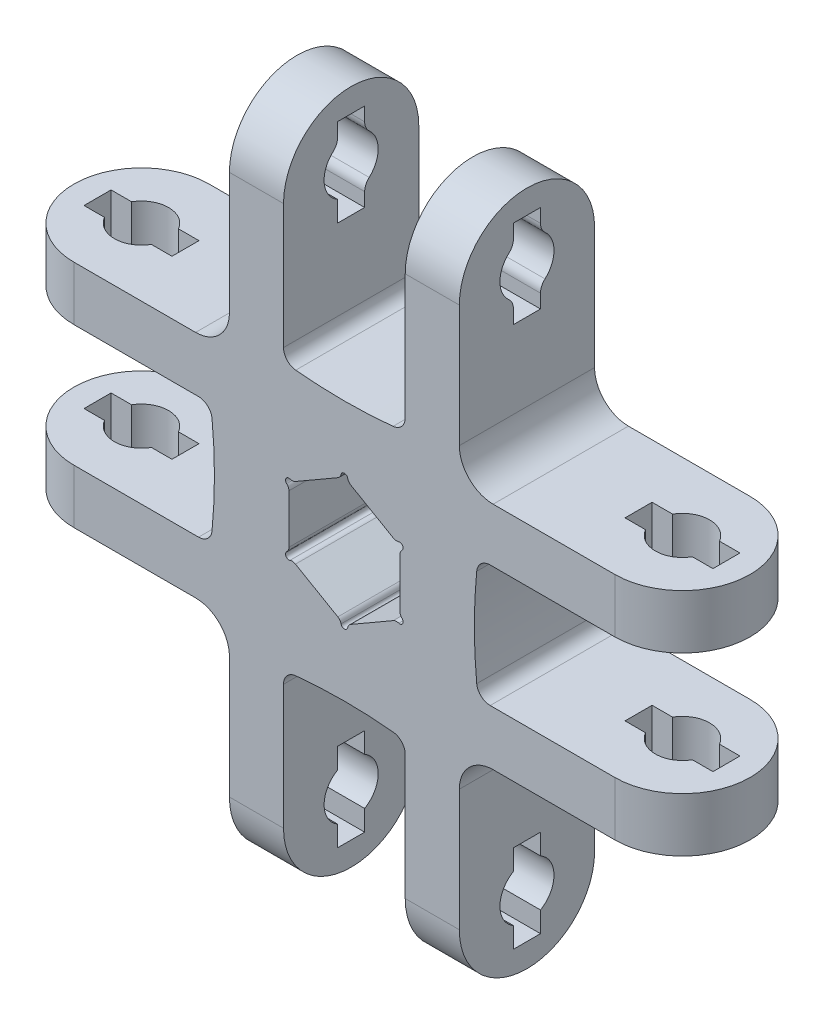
from build123d import *

# Parameters (mm, degrees)
BOSS_EXTRUDE1_DEPTH     = 10
SKETCH4_R               = 2
CUT_EXTRUDE3_DEPTH      = 46.885165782
SKETCH4_4_W             = 10
SKETCH4_4_H             = 0.975926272
CUT_EXTRUDE4_DEPTH      = 46.885165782
CIRPATTERN1_COUNT       = 4
FILLET1_R               = 2.5
FILLET2_R               = 1
CUT_EXTRUDE5_DEPTH      = 37.742346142
CUT_EXTRUDE5_DEPTH_BACK = 37.742346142
SKETCH5_R               = 0.25
FILLET3_R               = 0.5
FILLET4_R               = 1


with BuildPart() as part:
    # Sketch1 → Boss-Extrude1 (new body)
    with BuildSketch(Plane.XY):
        with BuildLine():
            ThreePointArc((8.5, 26.153393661), (6.518290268, 26.716322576), (4.5, 27.129319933))
            Line((4.5, 27.129319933), (4.5, 9.884822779))
            ThreePointArc((4.5, 9.884822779), (0, 9.60763872), (-4.5, 9.884822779))
            Line((-4.5, 9.884822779), (-4.5, 27.129319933))
            ThreePointArc((-4.5, 27.129319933), (-6.518290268, 26.716322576), (-8.5, 26.153393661))
            Line((-8.5, 26.153393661), (-8.5, 8.5))
            Line((-8.5, 8.5), (-26.153393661, 8.5))
            ThreePointArc((-26.153393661, 8.5), (-26.716322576, 6.518290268), (-27.129319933, 4.5))
            Line((-27.129319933, 4.5), (-9.884822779, 4.5))
            ThreePointArc((-9.884822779, 4.5), (-9.60763872, 0), (-9.884822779, -4.5))
            Line((-9.884822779, -4.5), (-27.129319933, -4.5))
            ThreePointArc((-27.129319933, -4.5), (-26.716322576, -6.518290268), (-26.153393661, -8.5))
            Line((-26.153393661, -8.5), (-8.5, -8.5))
            Line((-8.5, -8.5), (-8.5, -26.153393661))
            ThreePointArc((-8.5, -26.153393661), (-6.518290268, -26.716322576), (-4.5, -27.129319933))
            Line((-4.5, -27.129319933), (-4.5, -9.884822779))
            ThreePointArc((-4.5, -9.884822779), (0, -9.60763872), (4.5, -9.884822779))
            Line((4.5, -9.884822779), (4.5, -27.129319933))
            ThreePointArc((4.5, -27.129319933), (6.518290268, -26.716322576), (8.5, -26.153393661))
            Line((8.5, -26.153393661), (8.5, -8.5))
            Line((8.5, -8.5), (26.153393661, -8.5))
            ThreePointArc((26.153393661, -8.5), (26.716322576, -6.518290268), (27.129319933, -4.5))
            Line((27.129319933, -4.5), (9.884822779, -4.5))
            ThreePointArc((9.884822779, -4.5), (9.60763872, 0), (9.884822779, 4.5))
            Line((9.884822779, 4.5), (27.129319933, 4.5))
            ThreePointArc((27.129319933, 4.5), (26.716322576, 6.518290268), (26.153393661, 8.5))
            Line((26.153393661, 8.5), (8.5, 8.5))
            Line((8.5, 8.5), (8.5, 26.153393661))
        make_face()
    extrude(amount=BOSS_EXTRUDE1_DEPTH)

    # Sketch4 → Cut-Extrude3 (cut, symmetric)
    with BuildSketch(Plane(origin=(8.5, 0, 0), x_dir=(0, 0, -1), z_dir=(1, 0, 0))):
        with Locations((-5, 20)):
            Circle(SKETCH4_R)
        with BuildLine():
            Line((-6, 18.267949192), (-6, 21.732050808))
            ThreePointArc((-6, 21.732050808), (-7, 20), (-6, 18.267949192))
        make_face()
        with BuildLine():
            Line((-4, 23.25), (-6, 23.25))
            Line((-6, 23.25), (-6, 21.732050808))
            ThreePointArc((-6, 21.732050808), (-5, 22), (-4, 21.732050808))
            Line((-4, 21.732050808), (-4, 23.25))
        make_face()
        with BuildLine():
            ThreePointArc((-3, 20), (-3.267949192, 21), (-4, 21.732050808))
            Line((-4, 21.732050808), (-4, 18.267949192))
            ThreePointArc((-4, 18.267949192), (-3.267949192, 19), (-3, 20))
        make_face()
        with BuildLine():
            ThreePointArc((-4, 18.267949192), (-5, 18), (-6, 18.267949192))
            Line((-6, 18.267949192), (-6, 16.75))
            Line((-6, 16.75), (-4, 16.75))
            Line((-4, 16.75), (-4, 18.267949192))
        make_face()
    cut_extrude3 = extrude(amount=CUT_EXTRUDE3_DEPTH, both=True, mode=Mode.SUBTRACT)

    # Sketch4_4 → Cut-Extrude4 (cut, symmetric)
    with BuildSketch(Plane(origin=(8.5, 0, 0), x_dir=(0, 0, -1), z_dir=(1, 0, 0))):
        with BuildLine():
            ThreePointArc((-10, 20), (-5, 25), (0, 20))
            Line((0, 20), (0, 26.153393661))
            Line((0, 26.153393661), (-10, 26.153393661))
            Line((-10, 26.153393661), (-10, 20))
        make_face()
        with Locations((-5, 26.641356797)):
            Rectangle(SKETCH4_4_W, SKETCH4_4_H)
    cut_extrude4 = extrude(amount=CUT_EXTRUDE4_DEPTH, both=True, mode=Mode.SUBTRACT)

    # CirPattern1: Cut-Extrude3, Cut-Extrude4 ×4 about axis
    cirpattern1_axis = Axis((0, 0, 0), (0, 0, 1))
    add([cut_extrude3.rotate(cirpattern1_axis, i * 360 / CIRPATTERN1_COUNT) for i in range(1, CIRPATTERN1_COUNT)], mode=Mode.SUBTRACT)
    add([cut_extrude4.rotate(cirpattern1_axis, i * 360 / CIRPATTERN1_COUNT) for i in range(1, CIRPATTERN1_COUNT)], mode=Mode.SUBTRACT)

    # Fillet1
    fillet1_edges = [part.edges().sort_by_distance(p)[0] for p in [
        (8.5, 8.5, 5),
        (8.5, -8.5, 5),
        (-8.5, -8.5, 5),
        (-8.5, 8.5, 5),
    ]]
    fillet(fillet1_edges, radius=FILLET1_R)

    # Fillet2
    fillet2_edges = [part.edges().sort_by_distance(p)[0] for p in [
        (-4.5, 9.884822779, 5),
        (4.5, 9.884822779, 5),
        (9.884822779, 4.5, 5),
        (9.884822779, -4.5, 5),
        (4.5, -9.884822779, 5),
        (-4.5, -9.884822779, 5),
        (-9.884822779, -4.5, 5),
        (-9.884822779, 4.5, 5),
    ]]
    fillet(fillet2_edges, radius=FILLET2_R)

    # Sketch5 → Cut-Extrude5 (cut, two sides: drawn at the far end of the back side and taken through both)
    with BuildSketch(Plane.XY.offset(10).offset(-CUT_EXTRUDE5_DEPTH_BACK)):
        with Locations((0, 4.734272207)):
            Circle(SKETCH5_R)
        with Locations((-4.1, 2.367136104)):
            Circle(SKETCH5_R)
        with Locations((-4.1, -2.367136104)):
            Circle(SKETCH5_R)
        with Locations((0, -4.734272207)):
            Circle(SKETCH5_R)
        with Locations((4.1, -2.367136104)):
            Circle(SKETCH5_R)
        with Locations((4.1, 2.367136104)):
            Circle(SKETCH5_R)
        Polygon((0, 4.734272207), (-4.1, 2.367136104), (-4.1, -2.367136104), (0, -4.734272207), (4.1, -2.367136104), (4.1, 2.367136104), align=None)
        with BuildLine():
            ThreePointArc((-0.216506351, 4.609272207), (0, 4.484272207), (0.216506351, 4.609272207))
            Line((0.216506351, 4.609272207), (0, 4.734272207))
            Line((0, 4.734272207), (-0.216506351, 4.609272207))
        make_face()
        with BuildLine():
            Line((0, 4.734272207), (0.216506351, 4.609272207))
            ThreePointArc((0.216506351, 4.609272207), (0.241481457, 4.669567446), (0.25, 4.734272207))
            ThreePointArc((0.25, 4.734272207), (-0.064704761, 4.975753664), (-0.216506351, 4.609272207))
            Line((-0.216506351, 4.609272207), (0, 4.734272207))
        make_face()
        with BuildLine():
            ThreePointArc((-0.216506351, 4.609272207), (0, 4.484272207), (0.216506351, 4.609272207))
            Line((0.216506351, 4.609272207), (0, 4.734272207))
            Line((0, 4.734272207), (-0.216506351, 4.609272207))
        make_face()
        with BuildLine():
            Line((0, 4.734272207), (0.216506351, 4.609272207))
            ThreePointArc((0.216506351, 4.609272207), (0.241481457, 4.669567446), (0.25, 4.734272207))
            ThreePointArc((0.25, 4.734272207), (-0.064704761, 4.975753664), (-0.216506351, 4.609272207))
            Line((-0.216506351, 4.609272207), (0, 4.734272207))
        make_face()
        with BuildLine():
            ThreePointArc((3.883493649, 2.492136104), (3.883493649, 2.242136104), (4.1, 2.117136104))
            Line((4.1, 2.117136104), (4.1, 2.367136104))
            Line((4.1, 2.367136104), (3.883493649, 2.492136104))
        make_face()
        with BuildLine():
            Line((4.1, 2.367136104), (4.1, 2.117136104))
            ThreePointArc((4.1, 2.117136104), (4.276776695, 2.190359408), (4.35, 2.367136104))
            ThreePointArc((4.35, 2.367136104), (4.164704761, 2.60861756), (3.883493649, 2.492136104))
            Line((3.883493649, 2.492136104), (4.1, 2.367136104))
        make_face()
        with BuildLine():
            ThreePointArc((3.883493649, 2.492136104), (3.883493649, 2.242136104), (4.1, 2.117136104))
            Line((4.1, 2.117136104), (4.1, 2.367136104))
            Line((4.1, 2.367136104), (3.883493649, 2.492136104))
        make_face()
        with BuildLine():
            Line((4.1, 2.367136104), (4.1, 2.117136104))
            ThreePointArc((4.1, 2.117136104), (4.276776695, 2.190359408), (4.35, 2.367136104))
            ThreePointArc((4.35, 2.367136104), (4.164704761, 2.60861756), (3.883493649, 2.492136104))
            Line((3.883493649, 2.492136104), (4.1, 2.367136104))
        make_face()
        with BuildLine():
            ThreePointArc((-3.883493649, 2.492136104), (-4.316506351, 2.492136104), (-4.1, 2.117136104))
            Line((-4.1, 2.117136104), (-4.1, 2.367136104))
            Line((-4.1, 2.367136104), (-3.883493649, 2.492136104))
        make_face()
        with BuildLine():
            Line((-4.1, 2.367136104), (-4.1, 2.117136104))
            ThreePointArc((-4.1, 2.117136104), (-3.923223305, 2.190359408), (-3.85, 2.367136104))
            ThreePointArc((-3.85, 2.367136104), (-3.858518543, 2.431840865), (-3.883493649, 2.492136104))
            Line((-3.883493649, 2.492136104), (-4.1, 2.367136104))
        make_face()
        with BuildLine():
            ThreePointArc((-3.883493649, 2.492136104), (-4.316506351, 2.492136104), (-4.1, 2.117136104))
            Line((-4.1, 2.117136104), (-4.1, 2.367136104))
            Line((-4.1, 2.367136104), (-3.883493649, 2.492136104))
        make_face()
        with BuildLine():
            Line((-4.1, 2.367136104), (-4.1, 2.117136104))
            ThreePointArc((-4.1, 2.117136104), (-3.923223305, 2.190359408), (-3.85, 2.367136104))
            ThreePointArc((-3.85, 2.367136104), (-3.858518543, 2.431840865), (-3.883493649, 2.492136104))
            Line((-3.883493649, 2.492136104), (-4.1, 2.367136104))
        make_face()
        with BuildLine():
            ThreePointArc((-4.1, -2.117136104), (-4.316506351, -2.492136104), (-3.883493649, -2.492136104))
            Line((-3.883493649, -2.492136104), (-4.1, -2.367136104))
            Line((-4.1, -2.367136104), (-4.1, -2.117136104))
        make_face()
        with BuildLine():
            Line((-4.1, -2.367136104), (-3.883493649, -2.492136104))
            ThreePointArc((-3.883493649, -2.492136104), (-3.858518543, -2.431840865), (-3.85, -2.367136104))
            ThreePointArc((-3.85, -2.367136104), (-3.923223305, -2.190359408), (-4.1, -2.117136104))
            Line((-4.1, -2.117136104), (-4.1, -2.367136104))
        make_face()
        with BuildLine():
            ThreePointArc((-4.1, -2.117136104), (-4.316506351, -2.492136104), (-3.883493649, -2.492136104))
            Line((-3.883493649, -2.492136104), (-4.1, -2.367136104))
            Line((-4.1, -2.367136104), (-4.1, -2.117136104))
        make_face()
        with BuildLine():
            Line((-4.1, -2.367136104), (-3.883493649, -2.492136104))
            ThreePointArc((-3.883493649, -2.492136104), (-3.858518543, -2.431840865), (-3.85, -2.367136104))
            ThreePointArc((-3.85, -2.367136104), (-3.923223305, -2.190359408), (-4.1, -2.117136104))
            Line((-4.1, -2.117136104), (-4.1, -2.367136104))
        make_face()
        with BuildLine():
            Line((-0.216506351, -4.609272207), (0, -4.734272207))
            Line((0, -4.734272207), (0.216506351, -4.609272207))
            ThreePointArc((0.216506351, -4.609272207), (0, -4.484272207), (-0.216506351, -4.609272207))
        make_face()
        with BuildLine():
            Line((0.216506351, -4.609272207), (0, -4.734272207))
            Line((0, -4.734272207), (-0.216506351, -4.609272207))
            ThreePointArc((-0.216506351, -4.609272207), (-0.064704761, -4.975753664), (0.25, -4.734272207))
            ThreePointArc((0.25, -4.734272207), (0.241481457, -4.669567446), (0.216506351, -4.609272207))
        make_face()
        with BuildLine():
            Line((-0.216506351, -4.609272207), (0, -4.734272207))
            Line((0, -4.734272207), (0.216506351, -4.609272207))
            ThreePointArc((0.216506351, -4.609272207), (0, -4.484272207), (-0.216506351, -4.609272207))
        make_face()
        with BuildLine():
            Line((0.216506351, -4.609272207), (0, -4.734272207))
            Line((0, -4.734272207), (-0.216506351, -4.609272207))
            ThreePointArc((-0.216506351, -4.609272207), (-0.064704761, -4.975753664), (0.25, -4.734272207))
            ThreePointArc((0.25, -4.734272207), (0.241481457, -4.669567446), (0.216506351, -4.609272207))
        make_face()
        with BuildLine():
            ThreePointArc((4.1, -2.117136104), (3.883493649, -2.242136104), (3.883493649, -2.492136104))
            Line((3.883493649, -2.492136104), (4.1, -2.367136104))
            Line((4.1, -2.367136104), (4.1, -2.117136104))
        make_face()
        with BuildLine():
            Line((4.1, -2.367136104), (3.883493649, -2.492136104))
            ThreePointArc((3.883493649, -2.492136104), (4.164704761, -2.60861756), (4.35, -2.367136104))
            ThreePointArc((4.35, -2.367136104), (4.276776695, -2.190359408), (4.1, -2.117136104))
            Line((4.1, -2.117136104), (4.1, -2.367136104))
        make_face()
        with BuildLine():
            ThreePointArc((4.1, -2.117136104), (3.883493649, -2.242136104), (3.883493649, -2.492136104))
            Line((3.883493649, -2.492136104), (4.1, -2.367136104))
            Line((4.1, -2.367136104), (4.1, -2.117136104))
        make_face()
        with BuildLine():
            Line((4.1, -2.367136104), (3.883493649, -2.492136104))
            ThreePointArc((3.883493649, -2.492136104), (4.164704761, -2.60861756), (4.35, -2.367136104))
            ThreePointArc((4.35, -2.367136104), (4.276776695, -2.190359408), (4.1, -2.117136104))
            Line((4.1, -2.117136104), (4.1, -2.367136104))
        make_face()
    extrude(amount=CUT_EXTRUDE5_DEPTH + CUT_EXTRUDE5_DEPTH_BACK, mode=Mode.SUBTRACT)

    # Fillet3
    fillet3_edges = [part.edges().sort_by_distance(p)[0] for p in [
        (-0.216506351, 4.609272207, 5),
        (0.216506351, 4.609272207, 5),
        (3.883493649, 2.492136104, 5),
        (4.1, 2.117136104, 5),
        (4.1, -2.117136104, 5),
        (3.883493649, -2.492136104, 5),
        (0.216506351, -4.609272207, 5),
        (-0.216506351, -4.609272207, 5),
        (-3.883493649, -2.492136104, 5),
        (-4.1, -2.117136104, 5),
        (-4.1, 2.117136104, 5),
        (-3.883493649, 2.492136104, 5),
    ]]
    fillet(fillet3_edges, radius=FILLET3_R)

    # Fillet4
    fillet4_edges = [part.edges().sort_by_distance(p)[0] for p in [
        (-6.5, 21.732050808, 6),
        (6.5, 21.732050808, 6),
        (-6.5, 21.732050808, 4),
        (6.5, 21.732050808, 4),
        (-6.5, 18.267949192, 4),
        (6.5, 18.267949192, 4),
        (6.5, 18.267949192, 6),
    ]]
    fillet(fillet4_edges, radius=FILLET4_R)


solid = part.part
